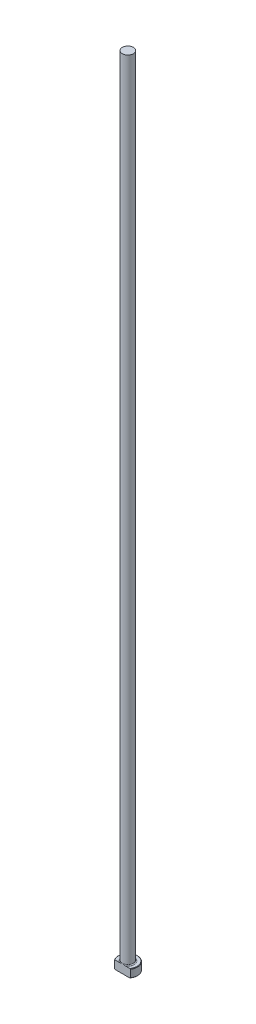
from build123d import *

# Parameters (mm, degrees)
CHAMFER1_SIZE = 0.254
FILLET1_R     = 0.508
KEY_DEPTH     = 458.267364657


with BuildPart() as part:
    # Sketch1 → Revolve1 (revolve)
    with BuildSketch(Plane.XY, mode=Mode.PRIVATE) as revolve1_sk:
        Polygon((0, 0), (-5.5499, 0), (-5.5499, 4.7498), (-3.175, 4.7498), (-3.175, 457.2), (0, 457.2), align=None)
    revolve(revolve1_sk.sketch.rotate(Axis((0, 259.958771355, 0), (0, -1, 0)), 270), axis=Axis((0, 259.958771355, 0), (0, -1, 0)))

    # Chamfer1
    chamfer1_edges = [part.edges().sort_by_distance(p)[0] for p in [
        (0, 4.7498, -5.5499),
        (0, 0, -5.5499),
    ]]
    chamfer(chamfer1_edges, length=CHAMFER1_SIZE)

    # Fillet1
    fillet1_edges = [part.edges().sort_by_distance(p)[0] for p in [
        (0, 4.7498, -3.175),
    ]]
    fillet(fillet1_edges, radius=FILLET1_R)

    # Sketch2 → Key (cut, through all)
    with BuildSketch(Plane(origin=(0, 0, 0), x_dir=(1, 0, 0), z_dir=(0, 1, 0))):
        with BuildLine():
            Line((-4.552006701, -3.175), (4.552006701, -3.175))
            ThreePointArc((4.552006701, -3.175), (0, -5.5499), (-4.552006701, -3.175))
        make_face()
    extrude(amount=KEY_DEPTH, mode=Mode.SUBTRACT)


solid = part.part
